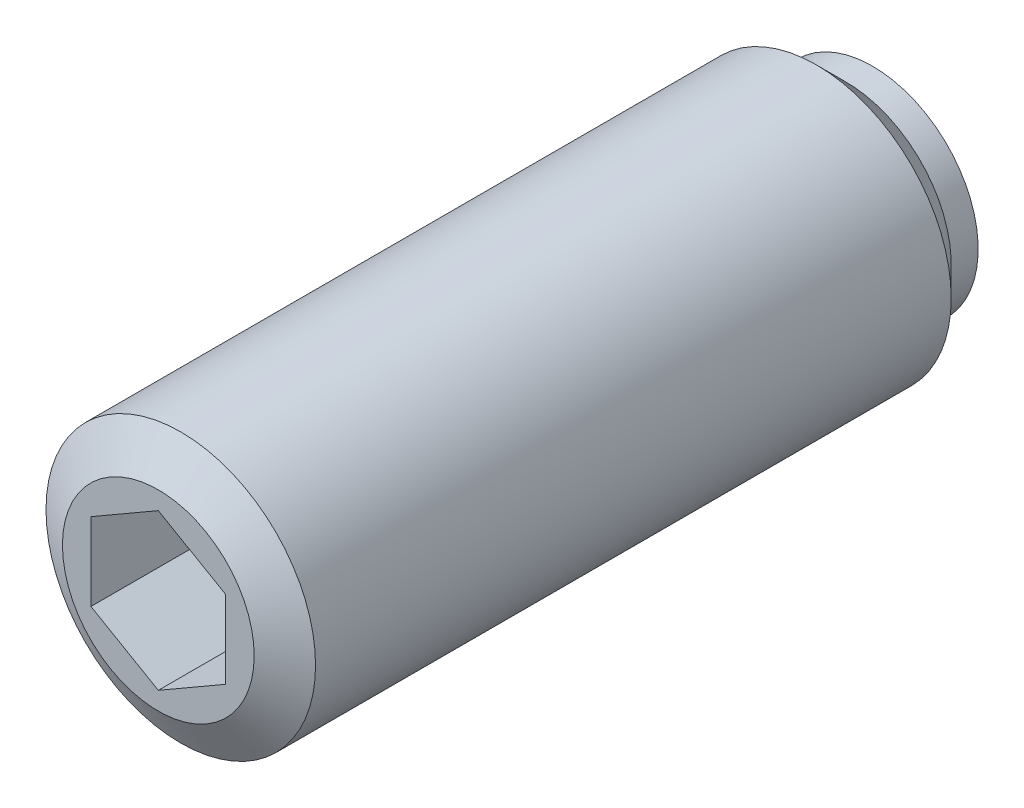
ISO-10303-21;
HEADER;
FILE_DESCRIPTION(('STEP AP214'),'2;1');
FILE_NAME('part.step','',(''),(''),'','','');
FILE_SCHEMA(('AUTOMOTIVE_DESIGN { 1 0 10303 214 1 1 1 1 }'));
ENDSEC;
DATA;
#1=APPLICATION_CONTEXT('core data for automotive mechanical design processes');
#2=APPLICATION_PROTOCOL_DEFINITION('international standard','automotive_design',2000,#1);
#3=PRODUCT_CONTEXT('',#1,'mechanical');
#4=PRODUCT('Part','Part','',(#3));
#5=PRODUCT_RELATED_PRODUCT_CATEGORY('part','',(#4));
#6=PRODUCT_DEFINITION_FORMATION('','',#4);
#7=PRODUCT_DEFINITION_CONTEXT('part definition',#1,'design');
#8=PRODUCT_DEFINITION('design','',#6,#7);
#9=PRODUCT_DEFINITION_SHAPE('','',#8);
#10=(LENGTH_UNIT() NAMED_UNIT(*) SI_UNIT(.MILLI.,.METRE.));
#11=(NAMED_UNIT(*) PLANE_ANGLE_UNIT() SI_UNIT($,.RADIAN.));
#12=(NAMED_UNIT(*) SI_UNIT($,.STERADIAN.) SOLID_ANGLE_UNIT());
#13=UNCERTAINTY_MEASURE_WITH_UNIT(LENGTH_MEASURE(1.E-05),#10,'distance_accuracy_value','');
#14=(GEOMETRIC_REPRESENTATION_CONTEXT(3) GLOBAL_UNCERTAINTY_ASSIGNED_CONTEXT((#13)) GLOBAL_UNIT_ASSIGNED_CONTEXT((#10,
#11,#12)) REPRESENTATION_CONTEXT('',''));
#15=CARTESIAN_POINT('',(0.,0.,0.));
#16=DIRECTION('',(0.,0.,1.));
#17=DIRECTION('',(1.,0.,0.));
#18=AXIS2_PLACEMENT_3D('',#15,#16,#17);
#19=CARTESIAN_POINT('',(0.,1.50253119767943,0.));
#20=DIRECTION('',(0.,0.,1.));
#21=DIRECTION('',(-1.,0.,0.));
#22=AXIS2_PLACEMENT_3D('',#19,#20,#21);
#23=PLANE('',#22);
#24=CARTESIAN_POINT('',(0.,0.,0.));
#25=DIRECTION('',(0.,0.,1.));
#26=DIRECTION('',(-1.,0.,0.));
#27=AXIS2_PLACEMENT_3D('',#24,#25,#26);
#28=CIRCLE('',#27,1.50253119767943);
#29=CARTESIAN_POINT('',(0.,1.50253119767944,0.));
#30=VERTEX_POINT('',#29);
#31=EDGE_CURVE('E9',#30,#30,#28,.T.);
#32=ORIENTED_EDGE('',*,*,#31,.F.);
#33=EDGE_LOOP('',(#32));
#34=FACE_BOUND('',#33,.T.);
#35=ADVANCED_FACE('F14',(#34),#23,.F.);
#36=CARTESIAN_POINT('',(0.,0.,1.32));
#37=DIRECTION('',(0.,0.,1.));
#38=DIRECTION('',(0.,1.,0.));
#39=AXIS2_PLACEMENT_3D('',#36,#37,#38);
#40=SPHERICAL_SURFACE('',#39,2.);
#41=CARTESIAN_POINT('',(0.,0.,0.4));
#42=DIRECTION('',(0.,0.,1.));
#43=DIRECTION('',(-1.,0.,0.));
#44=AXIS2_PLACEMENT_3D('',#41,#42,#43);
#45=CIRCLE('',#44,1.77583783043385);
#46=CARTESIAN_POINT('',(0.,1.77583783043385,0.4));
#47=VERTEX_POINT('',#46);
#48=EDGE_CURVE('E21',#47,#47,#45,.T.);
#49=CARTESIAN_POINT('',(0.,1.77583783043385,0.4));
#50=CARTESIAN_POINT('',(0.,1.77351077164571,0.395508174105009));
#51=CARTESIAN_POINT('',(0.,1.77116666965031,0.391025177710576));
#52=CARTESIAN_POINT('',(0.,1.76644451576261,0.382077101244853));
#53=CARTESIAN_POINT('',(0.,1.76406646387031,0.377612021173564));
#54=CARTESIAN_POINT('',(0.,1.75927654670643,0.368700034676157));
#55=CARTESIAN_POINT('',(0.,1.75686468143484,0.36425312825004));
#56=CARTESIAN_POINT('',(0.,1.75200727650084,0.355377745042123));
#57=CARTESIAN_POINT('',(0.,1.74956173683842,0.350949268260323));
#58=CARTESIAN_POINT('',(0.,1.74463712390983,0.342110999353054));
#59=CARTESIAN_POINT('',(0.,1.74215805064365,0.337701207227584));
#60=CARTESIAN_POINT('',(0.,1.73716651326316,0.328900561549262));
#61=CARTESIAN_POINT('',(0.,1.73465404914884,0.324509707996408));
#62=CARTESIAN_POINT('',(0.,1.72959587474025,0.315747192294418));
#63=CARTESIAN_POINT('',(0.,1.72705016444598,0.311375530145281));
#64=CARTESIAN_POINT('',(0.,1.72192564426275,0.302651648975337));
#65=CARTESIAN_POINT('',(0.,1.71934683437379,0.29829942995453));
#66=CARTESIAN_POINT('',(0.,1.71415626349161,0.289614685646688));
#67=CARTESIAN_POINT('',(0.,1.71154450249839,0.285282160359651));
#68=CARTESIAN_POINT('',(0.,1.7062881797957,0.276637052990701));
#69=CARTESIAN_POINT('',(0.,1.70364361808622,0.272324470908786));
#70=CARTESIAN_POINT('',(0.,1.69832184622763,0.263719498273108));
#71=CARTESIAN_POINT('',(0.,1.69564463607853,0.259427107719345));
#72=CARTESIAN_POINT('',(0.,1.69025772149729,0.250862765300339));
#73=CARTESIAN_POINT('',(0.,1.68754801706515,0.246590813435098));
#74=CARTESIAN_POINT('',(0.,1.68209626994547,0.238067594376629));
#75=CARTESIAN_POINT('',(0.,1.67935422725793,0.233816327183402));
#76=CARTESIAN_POINT('',(0.,1.67383796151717,0.225334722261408));
#77=CARTESIAN_POINT('',(0.,1.67106373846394,0.221104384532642));
#78=CARTESIAN_POINT('',(0.,1.66548327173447,0.212664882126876));
#79=CARTESIAN_POINT('',(0.,1.66267702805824,0.208455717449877));
#80=CARTESIAN_POINT('',(0.,1.65703268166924,0.200058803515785));
#81=CARTESIAN_POINT('',(0.,1.65419457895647,0.195871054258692));
#82=CARTESIAN_POINT('',(0.,1.64848667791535,0.18751721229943));
#83=CARTESIAN_POINT('',(0.,1.645616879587,0.18335111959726));
#84=CARTESIAN_POINT('',(0.,1.63984575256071,0.175040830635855));
#85=CARTESIAN_POINT('',(0.,1.63694442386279,0.170896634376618));
#86=CARTESIAN_POINT('',(0.,1.63111040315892,0.162630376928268));
#87=CARTESIAN_POINT('',(0.,1.62817771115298,0.158508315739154));
#88=CARTESIAN_POINT('',(0.,1.62228113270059,0.150286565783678));
#89=CARTESIAN_POINT('',(0.,1.61931724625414,0.146186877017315));
#90=CARTESIAN_POINT('',(0.,1.61335844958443,0.138010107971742));
#91=CARTESIAN_POINT('',(0.,1.61036353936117,0.133933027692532));
#92=CARTESIAN_POINT('',(0.,1.60434286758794,0.125801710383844));
#93=CARTESIAN_POINT('',(0.,1.60131710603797,0.121747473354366));
#94=CARTESIAN_POINT('',(0.,1.59523490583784,0.113662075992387));
#95=CARTESIAN_POINT('',(0.,1.59217846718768,0.109630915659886));
#96=CARTESIAN_POINT('',(0.,1.58603508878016,0.101591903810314));
#97=CARTESIAN_POINT('',(0.,1.58294814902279,0.0975840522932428));
#98=CARTESIAN_POINT('',(0.,1.57674394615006,0.0895918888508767));
#99=CARTESIAN_POINT('',(0.,1.57362668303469,0.0856075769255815));
#100=CARTESIAN_POINT('',(0.,1.56736201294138,0.0776627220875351));
#101=CARTESIAN_POINT('',(0.,1.56421460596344,0.0737021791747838));
#102=CARTESIAN_POINT('',(0.,1.55788982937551,0.0658050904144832));
#103=CARTESIAN_POINT('',(0.,1.55471245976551,0.0618685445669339));
#104=CARTESIAN_POINT('',(0.,1.54832794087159,0.0540196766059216));
#105=CARTESIAN_POINT('',(0.,1.54512079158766,0.0501073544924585));
#106=CARTESIAN_POINT('',(0.,1.53867689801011,0.0423071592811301));
#107=CARTESIAN_POINT('',(0.,1.53544015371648,0.0384192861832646));
#108=CARTESIAN_POINT('',(0.,1.52893725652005,0.0306682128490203));
#109=CARTESIAN_POINT('',(0.,1.52567110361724,0.0268050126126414));
#110=CARTESIAN_POINT('',(0.,1.5191095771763,0.019103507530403));
#111=CARTESIAN_POINT('',(0.,1.51581420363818,0.0152652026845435));
#112=CARTESIAN_POINT('',(0.,1.50919442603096,0.00761370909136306));
#113=CARTESIAN_POINT('',(0.,1.50587002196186,0.00380052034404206));
#114=CARTESIAN_POINT('',(0.,1.50253119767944,0.));
#115=B_SPLINE_CURVE_WITH_KNOTS('',3,(#49,#50,#51,#52,#53,#54,#55,#56,#57,#58,#59,#60,#61,#62,
#63,#64,#65,#66,#67,#68,#69,#70,#71,#72,#73,#74,#75,#76,#77,#78,#79,#80,#81,#82,#83,#84,#85,#86,
#87,#88,#89,#90,#91,#92,#93,#94,#95,#96,#97,#98,#99,#100,#101,#102,#103,#104,#105,#106,#107,
#108,#109,#110,#111,#112,#113,#114),.UNSPECIFIED.,.F.,.F.,(4,2,2,2,2,2,2,2,2,2,2,2,2,2,2,2,2,2,
2,2,2,2,2,2,2,2,2,2,2,2,2,2,4),(0.,0.0151764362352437,0.0303528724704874,0.0455293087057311,
0.0607057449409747,0.0758821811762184,0.0910586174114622,0.106235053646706,0.121411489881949,
0.136587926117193,0.151764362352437,0.16694079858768,0.182117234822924,0.197293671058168,
0.212470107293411,0.227646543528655,0.242822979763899,0.257999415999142,0.273175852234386,
0.28835228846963,0.303528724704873,0.318705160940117,0.33388159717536,0.349058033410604,
0.364234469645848,0.379410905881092,0.394587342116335,0.409763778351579,0.424940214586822,
0.440116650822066,0.45529308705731,0.470469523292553,0.485645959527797),.UNSPECIFIED.);
#116=EDGE_CURVE('BSEAM141',#47,#30,#115,.T.);
#117=ORIENTED_EDGE('',*,*,#48,.F.);
#118=ORIENTED_EDGE('',*,*,#31,.T.);
#119=ORIENTED_EDGE('',*,*,#116,.T.);
#120=ORIENTED_EDGE('',*,*,#116,.F.);
#121=EDGE_LOOP('',(#117,#119,#118,#120));
#122=FACE_BOUND('',#121,.T.);
#123=ADVANCED_FACE('F141',(#122),#40,.T.);
#124=CARTESIAN_POINT('',(0.,2.35,0.4));
#125=DIRECTION('',(0.,0.,1.));
#126=DIRECTION('',(-1.,0.,0.));
#127=AXIS2_PLACEMENT_3D('',#124,#125,#126);
#128=PLANE('',#127);
#129=CARTESIAN_POINT('',(0.,0.,0.4));
#130=DIRECTION('',(0.,0.,1.));
#131=DIRECTION('',(-1.,0.,0.));
#132=AXIS2_PLACEMENT_3D('',#129,#130,#131);
#133=CIRCLE('',#132,2.35);
#134=CARTESIAN_POINT('',(-2.35,0.,0.4));
#135=VERTEX_POINT('',#134);
#136=EDGE_CURVE('E134',#135,#135,#133,.T.);
#137=ORIENTED_EDGE('',*,*,#136,.F.);
#138=EDGE_LOOP('',(#137));
#139=FACE_BOUND('',#138,.T.);
#140=ORIENTED_EDGE('',*,*,#48,.T.);
#141=EDGE_LOOP('',(#140));
#142=FACE_BOUND('',#141,.T.);
#143=ADVANCED_FACE('F139',(#139,#142),#128,.F.);
#144=CARTESIAN_POINT('',(0.,0.,17.6950749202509));
#145=DIRECTION('',(0.,0.,1.));
#146=DIRECTION('',(-1.,0.,0.));
#147=AXIS2_PLACEMENT_3D('',#144,#145,#146);
#148=CYLINDRICAL_SURFACE('',#147,2.35);
#149=CARTESIAN_POINT('',(0.,0.,1.));
#150=DIRECTION('',(0.,0.,1.));
#151=DIRECTION('',(-1.,0.,0.));
#152=AXIS2_PLACEMENT_3D('',#149,#150,#151);
#153=CIRCLE('',#152,2.35);
#154=CARTESIAN_POINT('',(-2.35,0.,1.));
#155=VERTEX_POINT('',#154);
#156=EDGE_CURVE('E131',#155,#155,#153,.T.);
#157=ORIENTED_EDGE('',*,*,#156,.F.);
#158=EDGE_LOOP('',(#157));
#159=FACE_BOUND('',#158,.T.);
#160=ORIENTED_EDGE('',*,*,#136,.T.);
#161=EDGE_LOOP('',(#160));
#162=FACE_BOUND('',#161,.T.);
#163=ADVANCED_FACE('F164',(#159,#162),#148,.T.);
#164=CARTESIAN_POINT('',(0.,0.,1.));
#165=DIRECTION('',(0.,0.,1.));
#166=DIRECTION('',(-1.,0.,0.));
#167=AXIS2_PLACEMENT_3D('',#164,#165,#166);
#168=CONICAL_SURFACE('',#167,2.35,0.785398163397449);
#169=CARTESIAN_POINT('',(0.,0.,1.65));
#170=DIRECTION('',(0.,0.,1.));
#171=DIRECTION('',(-1.,0.,0.));
#172=AXIS2_PLACEMENT_3D('',#169,#170,#171);
#173=CIRCLE('',#172,3.);
#174=CARTESIAN_POINT('',(-3.,0.,1.65));
#175=VERTEX_POINT('',#174);
#176=EDGE_CURVE('E128',#175,#175,#173,.T.);
#177=ORIENTED_EDGE('',*,*,#176,.F.);
#178=EDGE_LOOP('',(#177));
#179=FACE_BOUND('',#178,.T.);
#180=ORIENTED_EDGE('',*,*,#156,.T.);
#181=EDGE_LOOP('',(#180));
#182=FACE_BOUND('',#181,.T.);
#183=ADVANCED_FACE('F173',(#179,#182),#168,.T.);
#184=CARTESIAN_POINT('',(0.,0.,17.6950749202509));
#185=DIRECTION('',(0.,0.,1.));
#186=DIRECTION('',(-1.,0.,0.));
#187=AXIS2_PLACEMENT_3D('',#184,#185,#186);
#188=CYLINDRICAL_SURFACE('',#187,3.);
#189=CARTESIAN_POINT('',(0.,0.,15.8));
#190=DIRECTION('',(0.,0.,1.));
#191=DIRECTION('',(-1.,0.,0.));
#192=AXIS2_PLACEMENT_3D('',#189,#190,#191);
#193=CIRCLE('',#192,3.);
#194=CARTESIAN_POINT('',(-3.,0.,15.8));
#195=VERTEX_POINT('',#194);
#196=EDGE_CURVE('E125',#195,#195,#193,.T.);
#197=ORIENTED_EDGE('',*,*,#196,.F.);
#198=EDGE_LOOP('',(#197));
#199=FACE_BOUND('',#198,.T.);
#200=ORIENTED_EDGE('',*,*,#176,.T.);
#201=EDGE_LOOP('',(#200));
#202=FACE_BOUND('',#201,.T.);
#203=ADVANCED_FACE('F182',(#199,#202),#188,.T.);
#204=CARTESIAN_POINT('',(0.,0.,15.8));
#205=DIRECTION('',(0.,0.,-1.));
#206=DIRECTION('',(1.,0.,0.));
#207=AXIS2_PLACEMENT_3D('',#204,#205,#206);
#208=CONICAL_SURFACE('',#207,3.,1.04719755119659);
#209=CARTESIAN_POINT('',(0.,0.,16.3));
#210=DIRECTION('',(0.,0.,1.));
#211=DIRECTION('',(-1.,0.,0.));
#212=AXIS2_PLACEMENT_3D('',#209,#210,#211);
#213=CIRCLE('',#212,2.13397459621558);
#214=CARTESIAN_POINT('',(-2.13397459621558,0.,16.3));
#215=VERTEX_POINT('',#214);
#216=EDGE_CURVE('E116',#215,#215,#213,.T.);
#217=ORIENTED_EDGE('',*,*,#216,.F.);
#218=EDGE_LOOP('',(#217));
#219=FACE_BOUND('',#218,.T.);
#220=ORIENTED_EDGE('',*,*,#196,.T.);
#221=EDGE_LOOP('',(#220));
#222=FACE_BOUND('',#221,.T.);
#223=ADVANCED_FACE('F191',(#219,#222),#208,.T.);
#224=CARTESIAN_POINT('',(0.,0.,16.3));
#225=DIRECTION('',(0.,0.,-1.));
#226=DIRECTION('',(1.,0.,0.));
#227=AXIS2_PLACEMENT_3D('',#224,#225,#226);
#228=PLANE('',#227);
#229=DIRECTION('',(-0.866025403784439,-0.5,0.));
#230=VECTOR('',#229,1.);
#231=CARTESIAN_POINT('',(0.,1.73205080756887,16.3));
#232=LINE('',#231,#230);
#233=CARTESIAN_POINT('',(0.,1.73205080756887,16.3));
#234=VERTEX_POINT('',#233);
#235=CARTESIAN_POINT('',(-1.5,0.866025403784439,16.3));
#236=VERTEX_POINT('',#235);
#237=EDGE_CURVE('E82',#234,#236,#232,.T.);
#238=ORIENTED_EDGE('',*,*,#237,.F.);
#239=DIRECTION('',(-0.866025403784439,0.5,0.));
#240=VECTOR('',#239,1.);
#241=CARTESIAN_POINT('',(1.5,0.866025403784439,16.3));
#242=LINE('',#241,#240);
#243=CARTESIAN_POINT('',(1.5,0.866025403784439,16.3));
#244=VERTEX_POINT('',#243);
#245=EDGE_CURVE('E28',#244,#234,#242,.T.);
#246=ORIENTED_EDGE('',*,*,#245,.F.);
#247=DIRECTION('',(0.,1.,0.));
#248=VECTOR('',#247,1.);
#249=CARTESIAN_POINT('',(1.5,-0.866025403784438,16.3));
#250=LINE('',#249,#248);
#251=CARTESIAN_POINT('',(1.5,-0.866025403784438,16.3));
#252=VERTEX_POINT('',#251);
#253=EDGE_CURVE('E98',#252,#244,#250,.T.);
#254=ORIENTED_EDGE('',*,*,#253,.F.);
#255=DIRECTION('',(0.866025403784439,0.5,0.));
#256=VECTOR('',#255,1.);
#257=CARTESIAN_POINT('',(0.,-1.73205080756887,16.3));
#258=LINE('',#257,#256);
#259=CARTESIAN_POINT('',(0.,-1.73205080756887,16.3));
#260=VERTEX_POINT('',#259);
#261=EDGE_CURVE('E92',#260,#252,#258,.T.);
#262=ORIENTED_EDGE('',*,*,#261,.F.);
#263=DIRECTION('',(0.866025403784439,-0.5,0.));
#264=VECTOR('',#263,1.);
#265=CARTESIAN_POINT('',(-1.5,-0.866025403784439,16.3));
#266=LINE('',#265,#264);
#267=CARTESIAN_POINT('',(-1.5,-0.866025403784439,16.3));
#268=VERTEX_POINT('',#267);
#269=EDGE_CURVE('E90',#268,#260,#266,.T.);
#270=ORIENTED_EDGE('',*,*,#269,.F.);
#271=DIRECTION('',(0.,-1.,0.));
#272=VECTOR('',#271,1.);
#273=CARTESIAN_POINT('',(-1.5,0.866025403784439,16.3));
#274=LINE('',#273,#272);
#275=EDGE_CURVE('E71',#236,#268,#274,.T.);
#276=ORIENTED_EDGE('',*,*,#275,.F.);
#277=EDGE_LOOP('',(#238,#246,#254,#262,#270,#276));
#278=FACE_BOUND('',#277,.T.);
#279=ORIENTED_EDGE('',*,*,#216,.T.);
#280=EDGE_LOOP('',(#279));
#281=FACE_BOUND('',#280,.T.);
#282=ADVANCED_FACE('F86',(#278,#281),#228,.F.);
#283=CARTESIAN_POINT('',(1.5,0.866025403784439,13.3));
#284=DIRECTION('',(0.5,0.866025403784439,0.));
#285=DIRECTION('',(0.866025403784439,-0.5,0.));
#286=AXIS2_PLACEMENT_3D('',#283,#284,#285);
#287=PLANE('',#286);
#288=ORIENTED_EDGE('',*,*,#245,.T.);
#289=DIRECTION('',(0.,0.,1.));
#290=VECTOR('',#289,1.);
#291=CARTESIAN_POINT('',(0.,1.73205080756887,13.3));
#292=LINE('',#291,#290);
#293=CARTESIAN_POINT('',(0.,1.73205080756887,13.3));
#294=VERTEX_POINT('',#293);
#295=EDGE_CURVE('E79',#294,#234,#292,.T.);
#296=ORIENTED_EDGE('',*,*,#295,.F.);
#297=DIRECTION('',(-0.866025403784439,0.5,0.));
#298=VECTOR('',#297,1.);
#299=CARTESIAN_POINT('',(1.5,0.866025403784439,13.3));
#300=LINE('',#299,#298);
#301=CARTESIAN_POINT('',(1.5,0.866025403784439,13.3));
#302=VERTEX_POINT('',#301);
#303=EDGE_CURVE('E100',#302,#294,#300,.T.);
#304=ORIENTED_EDGE('',*,*,#303,.F.);
#305=DIRECTION('',(0.,0.,1.));
#306=VECTOR('',#305,1.);
#307=CARTESIAN_POINT('',(1.5,0.866025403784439,13.3));
#308=LINE('',#307,#306);
#309=EDGE_CURVE('E35',#302,#244,#308,.T.);
#310=ORIENTED_EDGE('',*,*,#309,.T.);
#311=EDGE_LOOP('',(#288,#296,#304,#310));
#312=FACE_BOUND('',#311,.T.);
#313=ADVANCED_FACE('F208',(#312),#287,.F.);
#314=CARTESIAN_POINT('',(1.5,-0.866025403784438,13.3));
#315=DIRECTION('',(1.,0.,0.));
#316=DIRECTION('',(0.,-1.,0.));
#317=AXIS2_PLACEMENT_3D('',#314,#315,#316);
#318=PLANE('',#317);
#319=ORIENTED_EDGE('',*,*,#253,.T.);
#320=ORIENTED_EDGE('',*,*,#309,.F.);
#321=DIRECTION('',(0.,1.,0.));
#322=VECTOR('',#321,1.);
#323=CARTESIAN_POINT('',(1.5,-0.866025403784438,13.3));
#324=LINE('',#323,#322);
#325=CARTESIAN_POINT('',(1.5,-0.866025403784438,13.3));
#326=VERTEX_POINT('',#325);
#327=EDGE_CURVE('E112',#326,#302,#324,.T.);
#328=ORIENTED_EDGE('',*,*,#327,.F.);
#329=DIRECTION('',(0.,0.,1.));
#330=VECTOR('',#329,1.);
#331=CARTESIAN_POINT('',(1.5,-0.866025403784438,13.3));
#332=LINE('',#331,#330);
#333=EDGE_CURVE('E117',#326,#252,#332,.T.);
#334=ORIENTED_EDGE('',*,*,#333,.T.);
#335=EDGE_LOOP('',(#319,#320,#328,#334));
#336=FACE_BOUND('',#335,.T.);
#337=ADVANCED_FACE('F216',(#336),#318,.F.);
#338=CARTESIAN_POINT('',(0.,-1.73205080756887,13.3));
#339=DIRECTION('',(0.5,-0.866025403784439,0.));
#340=DIRECTION('',(-0.866025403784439,-0.5,0.));
#341=AXIS2_PLACEMENT_3D('',#338,#339,#340);
#342=PLANE('',#341);
#343=ORIENTED_EDGE('',*,*,#261,.T.);
#344=ORIENTED_EDGE('',*,*,#333,.F.);
#345=DIRECTION('',(0.866025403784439,0.5,0.));
#346=VECTOR('',#345,1.);
#347=CARTESIAN_POINT('',(0.,-1.73205080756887,13.3));
#348=LINE('',#347,#346);
#349=CARTESIAN_POINT('',(0.,-1.73205080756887,13.3));
#350=VERTEX_POINT('',#349);
#351=EDGE_CURVE('E109',#350,#326,#348,.T.);
#352=ORIENTED_EDGE('',*,*,#351,.F.);
#353=DIRECTION('',(0.,0.,1.));
#354=VECTOR('',#353,1.);
#355=CARTESIAN_POINT('',(0.,-1.73205080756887,13.3));
#356=LINE('',#355,#354);
#357=EDGE_CURVE('E119',#350,#260,#356,.T.);
#358=ORIENTED_EDGE('',*,*,#357,.T.);
#359=EDGE_LOOP('',(#343,#344,#352,#358));
#360=FACE_BOUND('',#359,.T.);
#361=ADVANCED_FACE('F224',(#360),#342,.F.);
#362=CARTESIAN_POINT('',(-1.5,-0.866025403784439,13.3));
#363=DIRECTION('',(-0.5,-0.866025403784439,0.));
#364=DIRECTION('',(-0.866025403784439,0.5,0.));
#365=AXIS2_PLACEMENT_3D('',#362,#363,#364);
#366=PLANE('',#365);
#367=ORIENTED_EDGE('',*,*,#269,.T.);
#368=ORIENTED_EDGE('',*,*,#357,.F.);
#369=DIRECTION('',(0.866025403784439,-0.5,0.));
#370=VECTOR('',#369,1.);
#371=CARTESIAN_POINT('',(-1.5,-0.866025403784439,13.3));
#372=LINE('',#371,#370);
#373=CARTESIAN_POINT('',(-1.5,-0.866025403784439,13.3));
#374=VERTEX_POINT('',#373);
#375=EDGE_CURVE('E106',#374,#350,#372,.T.);
#376=ORIENTED_EDGE('',*,*,#375,.F.);
#377=DIRECTION('',(0.,0.,1.));
#378=VECTOR('',#377,1.);
#379=CARTESIAN_POINT('',(-1.5,-0.866025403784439,13.3));
#380=LINE('',#379,#378);
#381=EDGE_CURVE('E78',#374,#268,#380,.T.);
#382=ORIENTED_EDGE('',*,*,#381,.T.);
#383=EDGE_LOOP('',(#367,#368,#376,#382));
#384=FACE_BOUND('',#383,.T.);
#385=ADVANCED_FACE('F232',(#384),#366,.F.);
#386=CARTESIAN_POINT('',(-1.5,0.866025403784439,13.3));
#387=DIRECTION('',(-1.,0.,0.));
#388=DIRECTION('',(0.,1.,0.));
#389=AXIS2_PLACEMENT_3D('',#386,#387,#388);
#390=PLANE('',#389);
#391=ORIENTED_EDGE('',*,*,#275,.T.);
#392=ORIENTED_EDGE('',*,*,#381,.F.);
#393=DIRECTION('',(0.,-1.,0.));
#394=VECTOR('',#393,1.);
#395=CARTESIAN_POINT('',(-1.5,0.866025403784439,13.3));
#396=LINE('',#395,#394);
#397=CARTESIAN_POINT('',(-1.5,0.866025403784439,13.3));
#398=VERTEX_POINT('',#397);
#399=EDGE_CURVE('E74',#398,#374,#396,.T.);
#400=ORIENTED_EDGE('',*,*,#399,.F.);
#401=DIRECTION('',(0.,0.,1.));
#402=VECTOR('',#401,1.);
#403=CARTESIAN_POINT('',(-1.5,0.866025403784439,13.3));
#404=LINE('',#403,#402);
#405=EDGE_CURVE('E67',#398,#236,#404,.T.);
#406=ORIENTED_EDGE('',*,*,#405,.T.);
#407=EDGE_LOOP('',(#391,#392,#400,#406));
#408=FACE_BOUND('',#407,.T.);
#409=ADVANCED_FACE('F69',(#408),#390,.F.);
#410=CARTESIAN_POINT('',(0.,1.73205080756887,13.3));
#411=DIRECTION('',(-0.5,0.866025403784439,0.));
#412=DIRECTION('',(0.866025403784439,0.5,0.));
#413=AXIS2_PLACEMENT_3D('',#410,#411,#412);
#414=PLANE('',#413);
#415=ORIENTED_EDGE('',*,*,#237,.T.);
#416=ORIENTED_EDGE('',*,*,#405,.F.);
#417=DIRECTION('',(-0.866025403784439,-0.5,0.));
#418=VECTOR('',#417,1.);
#419=CARTESIAN_POINT('',(0.,1.73205080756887,13.3));
#420=LINE('',#419,#418);
#421=EDGE_CURVE('E103',#294,#398,#420,.T.);
#422=ORIENTED_EDGE('',*,*,#421,.F.);
#423=ORIENTED_EDGE('',*,*,#295,.T.);
#424=EDGE_LOOP('',(#415,#416,#422,#423));
#425=FACE_BOUND('',#424,.T.);
#426=ADVANCED_FACE('F83',(#425),#414,.F.);
#427=CARTESIAN_POINT('',(3.,0.,13.3));
#428=DIRECTION('',(0.,0.,-1.));
#429=DIRECTION('',(1.,0.,0.));
#430=AXIS2_PLACEMENT_3D('',#427,#428,#429);
#431=PLANE('',#430);
#432=ORIENTED_EDGE('',*,*,#303,.T.);
#433=ORIENTED_EDGE('',*,*,#421,.T.);
#434=ORIENTED_EDGE('',*,*,#399,.T.);
#435=ORIENTED_EDGE('',*,*,#375,.T.);
#436=ORIENTED_EDGE('',*,*,#351,.T.);
#437=ORIENTED_EDGE('',*,*,#327,.T.);
#438=EDGE_LOOP('',(#432,#433,#434,#435,#436,#437));
#439=FACE_BOUND('',#438,.T.);
#440=ADVANCED_FACE('F256',(#439),#431,.F.);
#441=CLOSED_SHELL('',(#35,#123,#143,#163,#183,#203,#223,#282,#313,#337,#361,#385,#409,#426,#440));
#442=MANIFOLD_SOLID_BREP('B1',#441);
#443=ADVANCED_BREP_SHAPE_REPRESENTATION('',(#18,#442),#14);
#444=SHAPE_DEFINITION_REPRESENTATION(#9,#443);
ENDSEC;
END-ISO-10303-21;
